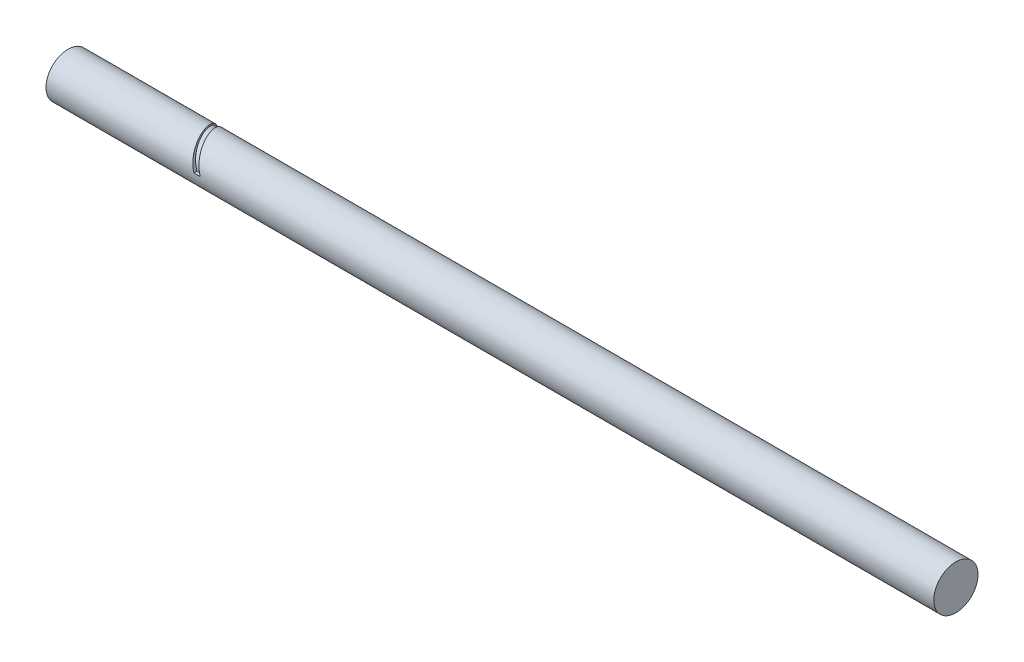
ISO-10303-21;
HEADER;
FILE_DESCRIPTION(('STEP AP214'),'2;1');
FILE_NAME('part.step','',(''),(''),'','','');
FILE_SCHEMA(('AUTOMOTIVE_DESIGN { 1 0 10303 214 1 1 1 1 }'));
ENDSEC;
DATA;
#1=APPLICATION_CONTEXT('core data for automotive mechanical design processes');
#2=APPLICATION_PROTOCOL_DEFINITION('international standard','automotive_design',2000,#1);
#3=PRODUCT_CONTEXT('',#1,'mechanical');
#4=PRODUCT('Part','Part','',(#3));
#5=PRODUCT_RELATED_PRODUCT_CATEGORY('part','',(#4));
#6=PRODUCT_DEFINITION_FORMATION('','',#4);
#7=PRODUCT_DEFINITION_CONTEXT('part definition',#1,'design');
#8=PRODUCT_DEFINITION('design','',#6,#7);
#9=PRODUCT_DEFINITION_SHAPE('','',#8);
#10=(LENGTH_UNIT() NAMED_UNIT(*) SI_UNIT(.MILLI.,.METRE.));
#11=(NAMED_UNIT(*) PLANE_ANGLE_UNIT() SI_UNIT($,.RADIAN.));
#12=(NAMED_UNIT(*) SI_UNIT($,.STERADIAN.) SOLID_ANGLE_UNIT());
#13=UNCERTAINTY_MEASURE_WITH_UNIT(LENGTH_MEASURE(1.E-05),#10,'distance_accuracy_value','');
#14=(GEOMETRIC_REPRESENTATION_CONTEXT(3) GLOBAL_UNCERTAINTY_ASSIGNED_CONTEXT((#13)) GLOBAL_UNIT_ASSIGNED_CONTEXT((#10,
#11,#12)) REPRESENTATION_CONTEXT('',''));
#15=CARTESIAN_POINT('',(0.,0.,0.));
#16=DIRECTION('',(0.,0.,1.));
#17=DIRECTION('',(1.,0.,0.));
#18=AXIS2_PLACEMENT_3D('',#15,#16,#17);
#19=CARTESIAN_POINT('',(3010.,0.,0.));
#20=DIRECTION('',(-1.,0.,0.));
#21=DIRECTION('',(0.,0.,1.));
#22=AXIS2_PLACEMENT_3D('',#19,#20,#21);
#23=CYLINDRICAL_SURFACE('',#22,87.375);
#24=DIRECTION('',(-1.,0.,0.));
#25=VECTOR('',#24,1.);
#26=CARTESIAN_POINT('',(3010.,0.,-87.375));
#27=LINE('',#26,#25);
#28=CARTESIAN_POINT('',(0.,0.,-87.375));
#29=VERTEX_POINT('',#28);
#30=CARTESIAN_POINT('',(20.,0.,-87.375));
#31=VERTEX_POINT('',#30);
#32=EDGE_CURVE('E253',#29,#31,#27,.F.);
#33=ORIENTED_EDGE('',*,*,#32,.T.);
#34=CARTESIAN_POINT('',(20.,0.,-87.375));
#35=CARTESIAN_POINT('',(20.4671642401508,1.50861786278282,-87.375036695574));
#36=CARTESIAN_POINT('',(20.9347925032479,3.01708702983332,-87.335929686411));
#37=CARTESIAN_POINT('',(21.8708867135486,6.02965014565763,-87.1797402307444));
#38=CARTESIAN_POINT('',(22.3393526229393,7.53374428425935,-87.0626612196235));
#39=CARTESIAN_POINT('',(23.2770656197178,10.5335897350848,-86.7508421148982));
#40=CARTESIAN_POINT('',(23.7463126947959,12.0293411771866,-86.5561032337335));
#41=CARTESIAN_POINT('',(24.6851978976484,15.0073260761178,-86.0897224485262));
#42=CARTESIAN_POINT('',(25.154835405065,16.4895694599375,-85.818142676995));
#43=CARTESIAN_POINT('',(26.0948836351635,19.4377960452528,-85.1987772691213));
#44=CARTESIAN_POINT('',(26.5652943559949,20.9037792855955,-84.8509918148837));
#45=CARTESIAN_POINT('',(27.5069142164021,23.8155736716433,-84.0801834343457));
#46=CARTESIAN_POINT('',(27.978123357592,25.2613847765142,-83.6571603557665));
#47=CARTESIAN_POINT('',(28.9214759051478,28.1293044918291,-82.7369404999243));
#48=CARTESIAN_POINT('',(29.3936195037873,29.5514074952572,-82.2397264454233));
#49=CARTESIAN_POINT('',(30.3387933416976,32.3677617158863,-81.1725710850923));
#50=CARTESIAN_POINT('',(30.8118235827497,33.7620128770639,-80.6026296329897));
#51=CARTESIAN_POINT('',(31.7587939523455,36.5189120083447,-79.3916018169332));
#52=CARTESIAN_POINT('',(32.2327340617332,37.8815606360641,-78.7505169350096));
#53=CARTESIAN_POINT('',(33.1815377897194,40.5719978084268,-77.3987759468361));
#54=CARTESIAN_POINT('',(33.6564015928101,41.8997784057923,-76.6881041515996));
#55=CARTESIAN_POINT('',(34.6069066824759,44.5166653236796,-75.1992249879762));
#56=CARTESIAN_POINT('',(35.0825479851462,45.8057708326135,-74.421016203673));
#57=CARTESIAN_POINT('',(36.0346330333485,48.3419797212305,-72.7991032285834));
#58=CARTESIAN_POINT('',(36.5110768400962,49.5890797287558,-71.9553937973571));
#59=CARTESIAN_POINT('',(37.3955936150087,51.8602956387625,-70.3317604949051));
#60=CARTESIAN_POINT('',(37.8035657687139,52.8905292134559,-69.560319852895));
#61=CARTESIAN_POINT('',(38.6201356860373,54.915868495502,-67.9727420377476));
#62=CARTESIAN_POINT('',(39.0287334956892,55.9109714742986,-67.1566014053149));
#63=CARTESIAN_POINT('',(39.8465460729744,57.8640217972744,-65.4813019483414));
#64=CARTESIAN_POINT('',(40.2557608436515,58.8219689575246,-64.6221429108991));
#65=CARTESIAN_POINT('',(41.0748675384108,60.6989385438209,-62.8624254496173));
#66=CARTESIAN_POINT('',(41.4847595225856,61.6179572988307,-61.9618631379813));
#67=CARTESIAN_POINT('',(42.3053169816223,63.4154433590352,-60.1209416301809));
#68=CARTESIAN_POINT('',(42.7159826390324,64.2938993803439,-59.180571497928));
#69=CARTESIAN_POINT('',(43.5379877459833,66.0084012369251,-57.2620021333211));
#70=CARTESIAN_POINT('',(43.9493272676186,66.8444421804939,-56.2837985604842));
#71=CARTESIAN_POINT('',(44.7725731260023,68.4723867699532,-54.2915979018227));
#72=CARTESIAN_POINT('',(45.1844794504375,69.2642913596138,-53.2776015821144));
#73=CARTESIAN_POINT('',(46.0088040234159,70.8023718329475,-51.2159023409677));
#74=CARTESIAN_POINT('',(46.4212222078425,71.5485529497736,-50.1682032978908));
#75=CARTESIAN_POINT('',(47.2475422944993,72.9954677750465,-48.0386629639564));
#76=CARTESIAN_POINT('',(47.6614454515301,73.6960960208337,-46.9567505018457));
#77=CARTESIAN_POINT('',(48.4897932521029,75.0486610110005,-44.7632568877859));
#78=CARTESIAN_POINT('',(48.9042378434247,75.7006021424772,-43.6516784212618));
#79=CARTESIAN_POINT('',(49.7337622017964,76.9546356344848,-41.4008987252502));
#80=CARTESIAN_POINT('',(50.1488420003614,77.5567254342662,-40.2616960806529));
#81=CARTESIAN_POINT('',(50.9796484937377,78.7098600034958,-37.9579739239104));
#82=CARTESIAN_POINT('',(51.3953751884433,79.2609047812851,-36.7934544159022));
#83=CARTESIAN_POINT('',(52.2273818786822,80.3108226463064,-34.4415531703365));
#84=CARTESIAN_POINT('',(52.6436617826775,80.8097034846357,-33.25417486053));
#85=CARTESIAN_POINT('',(53.4768508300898,81.7544918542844,-30.8585765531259));
#86=CARTESIAN_POINT('',(53.8937600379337,82.2003935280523,-29.6503542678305));
#87=CARTESIAN_POINT('',(54.7281540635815,83.0383130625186,-27.215561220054));
#88=CARTESIAN_POINT('',(55.145638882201,83.4303308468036,-25.9889904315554));
#89=CARTESIAN_POINT('',(55.9811375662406,84.1596980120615,-23.5200463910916));
#90=CARTESIAN_POINT('',(56.3991513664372,84.4970535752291,-22.2776749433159));
#91=CARTESIAN_POINT('',(57.2368133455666,85.1172881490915,-19.7763093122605));
#92=CARTESIAN_POINT('',(57.6564629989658,85.4000289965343,-18.5172813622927));
#93=CARTESIAN_POINT('',(58.4963523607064,85.9094542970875,-15.9881302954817));
#94=CARTESIAN_POINT('',(58.9165920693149,86.1361387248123,-14.7180071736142));
#95=CARTESIAN_POINT('',(59.7577162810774,86.5330298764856,-12.1691777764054));
#96=CARTESIAN_POINT('',(60.1786007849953,86.7032365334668,-10.8904714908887));
#97=CARTESIAN_POINT('',(61.0210094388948,86.9868662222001,-8.32698684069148));
#98=CARTESIAN_POINT('',(61.4425335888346,87.1002892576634,-7.04220847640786));
#99=CARTESIAN_POINT('',(62.2861497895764,87.2701540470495,-4.46913383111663));
#100=CARTESIAN_POINT('',(62.7082418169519,87.3265980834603,-3.18083769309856));
#101=CARTESIAN_POINT('',(63.5530362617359,87.3824299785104,-0.603077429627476));
#102=CARTESIAN_POINT('',(63.9757387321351,87.3818125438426,0.686386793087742));
#103=CARTESIAN_POINT('',(64.8216730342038,87.323536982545,3.2637204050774));
#104=CARTESIAN_POINT('',(65.2449048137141,87.2658840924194,4.55158992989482));
#105=CARTESIAN_POINT('',(66.0919848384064,87.093675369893,7.12344857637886));
#106=CARTESIAN_POINT('',(66.5158331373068,86.9791142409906,8.40743732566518));
#107=CARTESIAN_POINT('',(67.3651056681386,86.6930042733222,10.9718753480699));
#108=CARTESIAN_POINT('',(67.7905312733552,86.5213236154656,12.2523094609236));
#109=CARTESIAN_POINT('',(68.6419920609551,86.1214062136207,14.8041192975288));
#110=CARTESIAN_POINT('',(69.0680272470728,85.8931691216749,16.0754949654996));
#111=CARTESIAN_POINT('',(69.9207018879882,85.3806145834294,18.6066836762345));
#112=CARTESIAN_POINT('',(70.3473413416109,85.0962972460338,19.8664967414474));
#113=CARTESIAN_POINT('',(71.201244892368,84.4721685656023,22.3720863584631));
#114=CARTESIAN_POINT('',(71.6285089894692,84.1323572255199,23.6178629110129));
#115=CARTESIAN_POINT('',(72.4836780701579,83.3979001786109,26.0930549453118));
#116=CARTESIAN_POINT('',(72.9115831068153,83.0032496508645,27.3224689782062));
#117=CARTESIAN_POINT('',(73.7679777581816,82.1599376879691,29.7624156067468));
#118=CARTESIAN_POINT('',(74.1964673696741,81.7112765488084,30.9729483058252));
#119=CARTESIAN_POINT('',(75.0540561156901,80.7608231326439,33.3728310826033));
#120=CARTESIAN_POINT('',(75.4831552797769,80.2590281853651,34.5621800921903));
#121=CARTESIAN_POINT('',(76.3419104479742,79.2033849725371,36.91719658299));
#122=CARTESIAN_POINT('',(76.7715663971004,78.6495415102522,38.0828662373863));
#123=CARTESIAN_POINT('',(77.6326013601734,77.4893689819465,40.3913533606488));
#124=CARTESIAN_POINT('',(78.0639819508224,76.8829073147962,41.5341036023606));
#125=CARTESIAN_POINT('',(78.9273260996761,75.6200151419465,43.7912803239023));
#126=CARTESIAN_POINT('',(79.3592896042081,74.9635889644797,44.9057092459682));
#127=CARTESIAN_POINT('',(80.2238285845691,73.6020025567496,47.104222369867));
#128=CARTESIAN_POINT('',(80.656404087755,72.8968400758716,48.1883051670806));
#129=CARTESIAN_POINT('',(81.5221163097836,71.439217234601,50.3239532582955));
#130=CARTESIAN_POINT('',(81.9552530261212,70.6867570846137,51.3755186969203));
#131=CARTESIAN_POINT('',(82.8220057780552,69.1362054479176,53.4438576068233));
#132=CARTESIAN_POINT('',(83.2556216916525,68.3381237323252,54.4606384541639));
#133=CARTESIAN_POINT('',(84.1234491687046,66.6977842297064,56.457647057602));
#134=CARTESIAN_POINT('',(84.5576607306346,65.8555265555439,57.4378749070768));
#135=CARTESIAN_POINT('',(85.4267230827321,64.1284787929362,59.3599026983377));
#136=CARTESIAN_POINT('',(85.8615738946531,63.2436872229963,60.3017012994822));
#137=CARTESIAN_POINT('',(86.731881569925,61.4334501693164,62.1449152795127));
#138=CARTESIAN_POINT('',(87.1673383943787,60.5080071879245,63.0463331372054));
#139=CARTESIAN_POINT('',(88.1855609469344,58.3002097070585,65.1034178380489));
#140=CARTESIAN_POINT('',(88.7685932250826,57.0025356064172,66.2425816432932));
#141=CARTESIAN_POINT('',(89.9356645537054,54.3423148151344,68.4418153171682));
#142=CARTESIAN_POINT('',(90.5197036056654,52.9797680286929,69.5018850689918));
#143=CARTESIAN_POINT('',(91.6887714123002,50.194588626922,71.5392955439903));
#144=CARTESIAN_POINT('',(92.2738001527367,48.7719568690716,72.5166374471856));
#145=CARTESIAN_POINT('',(93.4451151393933,45.8710282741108,74.3856016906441));
#146=CARTESIAN_POINT('',(94.0314018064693,44.3927085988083,75.2771883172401));
#147=CARTESIAN_POINT('',(95.2050427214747,41.3861742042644,76.9711146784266));
#148=CARTESIAN_POINT('',(95.7923969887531,39.8579585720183,77.7734527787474));
#149=CARTESIAN_POINT('',(96.9682554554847,36.75693408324,79.2861560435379));
#150=CARTESIAN_POINT('',(97.5567597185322,35.1841226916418,79.9965159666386));
#151=CARTESIAN_POINT('',(98.6363021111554,32.2661016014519,81.211774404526));
#152=CARTESIAN_POINT('',(99.1271729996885,30.9268405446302,81.7311636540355));
#153=CARTESIAN_POINT('',(100.109711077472,28.2244474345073,82.7032841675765));
#154=CARTESIAN_POINT('',(100.60137833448,26.8613132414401,83.1560094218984));
#155=CARTESIAN_POINT('',(101.585460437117,24.1145392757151,83.993698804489));
#156=CARTESIAN_POINT('',(102.077875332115,22.7308980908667,84.3786582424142));
#157=CARTESIAN_POINT('',(103.063433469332,19.9464980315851,85.0798982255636));
#158=CARTESIAN_POINT('',(103.556576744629,18.5457383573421,85.3961755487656));
#159=CARTESIAN_POINT('',(104.544454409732,15.7280478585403,85.9597992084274));
#160=CARTESIAN_POINT('',(105.039190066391,14.3110925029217,86.2070206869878));
#161=CARTESIAN_POINT('',(106.029376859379,11.4669797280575,86.63120856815));
#162=CARTESIAN_POINT('',(106.52482798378,10.0398224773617,86.8081761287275));
#163=CARTESIAN_POINT('',(107.516465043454,7.17879944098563,87.0914545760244));
#164=CARTESIAN_POINT('',(108.012650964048,5.74493378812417,87.1977668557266));
#165=CARTESIAN_POINT('',(109.005764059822,2.87400175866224,87.3395542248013));
#166=CARTESIAN_POINT('',(109.502691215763,1.43693546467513,87.3750311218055));
#167=CARTESIAN_POINT('',(110.,0.,87.375));
#168=B_SPLINE_CURVE_WITH_KNOTS('',3,(#34,#35,#36,#37,#38,#39,#40,#41,#42,#43,#44,#45,#46,#47,
#48,#49,#50,#51,#52,#53,#54,#55,#56,#57,#58,#59,#60,#61,#62,#63,#64,#65,#66,#67,#68,#69,#70,#71,
#72,#73,#74,#75,#76,#77,#78,#79,#80,#81,#82,#83,#84,#85,#86,#87,#88,#89,#90,#91,#92,#93,#94,#95,
#96,#97,#98,#99,#100,#101,#102,#103,#104,#105,#106,#107,#108,#109,#110,#111,#112,#113,#114,#115,
#116,#117,#118,#119,#120,#121,#122,#123,#124,#125,#126,#127,#128,#129,#130,#131,#132,#133,#134,
#135,#136,#137,#138,#139,#140,#141,#142,#143,#144,#145,#146,#147,#148,#149,#150,#151,#152,#153,
#154,#155,#156,#157,#158,#159,#160,#161,#162,#163,#164,#165,#166,#167),.UNSPECIFIED.,.F.,.F.,(4,
2,2,2,2,2,2,2,2,2,2,2,2,2,2,2,2,2,2,2,2,2,2,2,2,2,2,2,2,2,2,2,2,2,2,2,2,2,2,2,2,2,2,2,2,2,2,2,2,
2,2,2,2,2,2,2,2,2,2,2,2,2,2,2,2,2,4),(0.,4.7373916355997,9.47457455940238,14.2116835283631,
18.9449730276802,23.6782512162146,28.4115389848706,33.1459307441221,37.8803320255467,
42.6146347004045,47.3500072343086,52.0854790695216,56.8213301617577,60.8706623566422,
64.9203083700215,68.969974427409,73.0200215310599,77.0711885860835,81.1228218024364,
85.1743683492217,89.2254503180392,93.2855997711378,97.3453829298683,101.405374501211,
105.465365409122,109.524752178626,113.58458735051,117.644428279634,121.703809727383,
125.773329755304,129.842851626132,133.912378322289,137.981904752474,142.051268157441,
146.121009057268,150.19037634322,154.260122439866,158.339326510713,162.418555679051,
166.497776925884,170.576997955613,174.656577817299,178.736135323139,182.815897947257,
186.89528444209,190.985267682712,195.074897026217,199.164715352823,203.254515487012,
207.343442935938,211.432359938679,215.521419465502,219.61022763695,225.074783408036,
230.53934724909,236.003833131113,241.470584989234,246.937436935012,252.404600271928,
256.95702424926,261.509858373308,266.063007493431,270.61637016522,275.1779131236,
279.739380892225,284.300758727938,288.862020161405),.UNSPECIFIED.);
#169=CARTESIAN_POINT('',(110.,0.,87.375));
#170=VERTEX_POINT('',#169);
#171=EDGE_CURVE('E13',#31,#170,#168,.T.);
#172=ORIENTED_EDGE('',*,*,#171,.T.);
#173=DIRECTION('',(-1.,0.,0.));
#174=VECTOR('',#173,1.);
#175=CARTESIAN_POINT('',(3010.,0.,87.375));
#176=LINE('',#175,#174);
#177=CARTESIAN_POINT('',(84.9999999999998,0.,87.375));
#178=VERTEX_POINT('',#177);
#179=EDGE_CURVE('E83',#178,#170,#176,.F.);
#180=ORIENTED_EDGE('',*,*,#179,.F.);
#181=CARTESIAN_POINT('',(84.9999999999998,0.,87.375));
#182=CARTESIAN_POINT('',(84.5366335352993,1.50976577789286,87.3750259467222));
#183=CARTESIAN_POINT('',(84.0714954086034,3.01898793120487,87.335870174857));
#184=CARTESIAN_POINT('',(83.1388207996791,6.03260120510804,87.1795481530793));
#185=CARTESIAN_POINT('',(82.6712843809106,7.53699245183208,87.06238395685));
#186=CARTESIAN_POINT('',(81.7349368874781,10.5372696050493,86.7503990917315));
#187=CARTESIAN_POINT('',(81.2661258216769,12.0331555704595,86.5555789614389));
#188=CARTESIAN_POINT('',(80.3285997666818,15.0117218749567,86.0889607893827));
#189=CARTESIAN_POINT('',(79.8598849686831,16.494411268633,85.8172205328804));
#190=CARTESIAN_POINT('',(79.1574656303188,18.7064613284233,85.3523687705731));
#191=CARTESIAN_POINT('',(78.9234264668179,19.4418395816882,85.1878711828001));
#192=CARTESIAN_POINT('',(78.4556827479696,20.9082126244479,84.8398788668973));
#193=CARTESIAN_POINT('',(78.2219781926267,21.6392074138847,84.6563841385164));
#194=CARTESIAN_POINT('',(77.7550288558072,23.0963418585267,84.2705028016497));
#195=CARTESIAN_POINT('',(77.5217840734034,23.8224815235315,84.0681162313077));
#196=CARTESIAN_POINT('',(77.0559623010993,25.2694532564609,83.6445679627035));
#197=CARTESIAN_POINT('',(76.8233853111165,25.9902853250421,83.4234062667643));
#198=CARTESIAN_POINT('',(76.1262159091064,28.1444399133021,82.7318289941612));
#199=CARTESIAN_POINT('',(75.6622754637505,29.569138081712,82.2333960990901));
#200=CARTESIAN_POINT('',(74.9655287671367,31.6849356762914,81.4311050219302));
#201=CARTESIAN_POINT('',(74.7331313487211,32.3866871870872,81.154555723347));
#202=CARTESIAN_POINT('',(74.2676326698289,33.7826194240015,80.583458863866));
#203=CARTESIAN_POINT('',(74.0345314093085,34.4768001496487,80.2889113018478));
#204=CARTESIAN_POINT('',(73.5677391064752,35.8571264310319,79.682027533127));
#205=CARTESIAN_POINT('',(73.3340480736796,36.5432721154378,79.3696916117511));
#206=CARTESIAN_POINT('',(72.8662687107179,37.9071187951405,78.7274361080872));
#207=CARTESIAN_POINT('',(72.6321803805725,38.5848197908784,78.3975165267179));
#208=CARTESIAN_POINT('',(71.9294494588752,40.6049640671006,77.3815207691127));
#209=CARTESIAN_POINT('',(71.4603988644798,41.934277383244,76.6692828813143));
#210=CARTESIAN_POINT('',(70.7571406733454,43.899172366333,75.5501274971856));
#211=CARTESIAN_POINT('',(70.5227625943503,44.5493230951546,75.1685890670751));
#212=CARTESIAN_POINT('',(70.0542433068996,45.8396176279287,74.3887641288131));
#213=CARTESIAN_POINT('',(69.8201020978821,46.479761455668,73.9904776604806));
#214=CARTESIAN_POINT('',(69.3522311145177,47.7496763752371,73.1773705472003));
#215=CARTESIAN_POINT('',(69.1185013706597,48.3794467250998,72.7625487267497));
#216=CARTESIAN_POINT('',(68.6515708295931,49.6281764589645,71.9166422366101));
#217=CARTESIAN_POINT('',(68.4183700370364,50.2471357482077,71.4855574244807));
#218=CARTESIAN_POINT('',(67.9205542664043,51.5573882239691,70.5475794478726));
#219=CARTESIAN_POINT('',(67.6559905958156,52.247039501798,70.0383631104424));
#220=CARTESIAN_POINT('',(67.1271141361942,53.6111233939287,68.9998037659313));
#221=CARTESIAN_POINT('',(66.8628013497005,54.2855558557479,68.4704605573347));
#222=CARTESIAN_POINT('',(66.3341872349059,55.6186192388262,67.3920979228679));
#223=CARTESIAN_POINT('',(66.0698859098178,56.2772487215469,66.8430767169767));
#224=CARTESIAN_POINT('',(65.5411034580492,57.5780194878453,65.7259256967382));
#225=CARTESIAN_POINT('',(65.2766223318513,58.2201608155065,65.1577959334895));
#226=CARTESIAN_POINT('',(64.7472708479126,59.4873777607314,64.0029483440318));
#227=CARTESIAN_POINT('',(64.4824004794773,60.1124528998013,63.4162299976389));
#228=CARTESIAN_POINT('',(63.9520277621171,61.3449285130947,62.224794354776));
#229=CARTESIAN_POINT('',(63.6865254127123,61.9523289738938,61.620077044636));
#230=CARTESIAN_POINT('',(63.1547728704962,63.1491723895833,60.3929421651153));
#231=CARTESIAN_POINT('',(62.8885224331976,63.7386084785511,59.7705179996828));
#232=CARTESIAN_POINT('',(62.3556875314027,64.8988187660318,58.5087059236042));
#233=CARTESIAN_POINT('',(62.0891030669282,65.4695929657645,57.8693180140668));
#234=CARTESIAN_POINT('',(61.2891746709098,67.153287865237,55.9264083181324));
#235=CARTESIAN_POINT('',(60.7555944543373,68.2377187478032,54.5979991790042));
#236=CARTESIAN_POINT('',(59.9564443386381,69.8043661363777,52.5592630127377));
#237=CARTESIAN_POINT('',(59.6902529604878,70.3166027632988,51.8719667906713));
#238=CARTESIAN_POINT('',(59.1584549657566,71.3207585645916,50.482419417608));
#239=CARTESIAN_POINT('',(58.89284834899,71.8126777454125,49.7801682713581));
#240=CARTESIAN_POINT('',(58.3625352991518,72.7758239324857,48.3611975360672));
#241=CARTESIAN_POINT('',(58.0978289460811,73.2470491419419,47.6444766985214));
#242=CARTESIAN_POINT('',(57.5689921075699,74.1682821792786,46.1973188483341));
#243=CARTESIAN_POINT('',(57.3048616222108,74.6182900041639,45.4668818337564));
#244=CARTESIAN_POINT('',(56.7766135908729,75.4966078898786,43.9930529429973));
#245=CARTESIAN_POINT('',(56.512496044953,75.9249178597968,43.2496610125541));
#246=CARTESIAN_POINT('',(56.1159692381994,76.5507613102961,42.1254737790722));
#247=CARTESIAN_POINT('',(55.9837335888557,76.7566079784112,41.7492234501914));
#248=CARTESIAN_POINT('',(55.7190728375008,77.1627121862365,40.993784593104));
#249=CARTESIAN_POINT('',(55.5866477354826,77.3629697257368,40.6145960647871));
#250=CARTESIAN_POINT('',(55.1891090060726,77.9552974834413,39.4727449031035));
#251=CARTESIAN_POINT('',(54.9237257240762,78.3389326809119,38.7057790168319));
#252=CARTESIAN_POINT('',(54.3924384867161,79.083388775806,37.1610464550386));
#253=CARTESIAN_POINT('',(54.1265345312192,79.4442096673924,36.3832797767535));
#254=CARTESIAN_POINT('',(53.5943963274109,80.1427232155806,34.8176566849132));
#255=CARTESIAN_POINT('',(53.328162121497,80.480418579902,34.0298014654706));
#256=CARTESIAN_POINT('',(52.7954954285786,81.13245980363,32.4445547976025));
#257=CARTESIAN_POINT('',(52.5290629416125,81.4468056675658,31.6471633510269));
#258=CARTESIAN_POINT('',(51.9961560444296,82.0518994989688,30.0434834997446));
#259=CARTESIAN_POINT('',(51.7296816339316,82.3426473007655,29.2371950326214));
#260=CARTESIAN_POINT('',(51.1968503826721,82.9003066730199,27.6163770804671));
#261=CARTESIAN_POINT('',(50.9304935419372,83.1672182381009,26.8018475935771));
#262=CARTESIAN_POINT('',(50.3980592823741,83.6769818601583,25.1652130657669));
#263=CARTESIAN_POINT('',(50.1319818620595,83.9198340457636,24.3431080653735));
#264=CARTESIAN_POINT('',(49.6002617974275,84.381278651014,22.6919635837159));
#265=CARTESIAN_POINT('',(49.3346191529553,84.5998710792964,21.8629241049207));
#266=CARTESIAN_POINT('',(48.9366063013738,84.9094234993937,20.6146609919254));
#267=CARTESIAN_POINT('',(48.8040031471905,85.0095566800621,20.1977659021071));
#268=CARTESIAN_POINT('',(48.5389687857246,85.2036875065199,19.3624919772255));
#269=CARTESIAN_POINT('',(48.4065375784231,85.2976851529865,18.9441131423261));
#270=CARTESIAN_POINT('',(48.1418714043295,85.4795229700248,18.1059568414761));
#271=CARTESIAN_POINT('',(48.0096364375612,85.5673631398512,17.6861793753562));
#272=CARTESIAN_POINT('',(47.811445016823,85.694488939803,17.0555320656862));
#273=CARTESIAN_POINT('',(47.745407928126,85.7360918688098,16.8451523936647));
#274=CARTESIAN_POINT('',(47.6132868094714,85.8177451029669,16.4241054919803));
#275=CARTESIAN_POINT('',(47.5472027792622,85.8577953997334,16.213438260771));
#276=CARTESIAN_POINT('',(47.3489090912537,85.975614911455,15.5810199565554));
#277=CARTESIAN_POINT('',(47.2166557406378,86.0510540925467,15.1588456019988));
#278=CARTESIAN_POINT('',(46.9520338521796,86.1957028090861,14.3134674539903));
#279=CARTESIAN_POINT('',(46.8196653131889,86.2649122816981,13.8902636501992));
#280=CARTESIAN_POINT('',(46.4224110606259,86.463175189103,12.6192462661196));
#281=CARTESIAN_POINT('',(46.1573688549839,86.5828677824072,11.7700016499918));
#282=CARTESIAN_POINT('',(45.6269676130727,86.7971888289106,10.0684614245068));
#283=CARTESIAN_POINT('',(45.3616085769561,86.8918172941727,9.21616581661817));
#284=CARTESIAN_POINT('',(44.8306597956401,87.0559414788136,7.50925548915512));
#285=CARTESIAN_POINT('',(44.5650700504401,87.125437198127,6.65464076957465));
#286=CARTESIAN_POINT('',(43.7680529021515,87.29613548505,4.08834034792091));
#287=CARTESIAN_POINT('',(43.2363369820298,87.3595655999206,2.37406798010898));
#288=CARTESIAN_POINT('',(42.1728731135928,87.3854567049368,-1.05509880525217));
#289=CARTESIAN_POINT('',(41.641125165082,87.3479169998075,-2.76999322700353));
#290=CARTESIAN_POINT('',(40.5780863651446,87.1719779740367,-6.19486919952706));
#291=CARTESIAN_POINT('',(40.0467955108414,87.0335792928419,-7.90485078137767));
#292=CARTESIAN_POINT('',(39.2507488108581,86.7506970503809,-10.4614851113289));
#293=CARTESIAN_POINT('',(38.9855449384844,86.6438538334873,-11.312317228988));
#294=CARTESIAN_POINT('',(38.5880011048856,86.4648295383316,-12.5860110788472));
#295=CARTESIAN_POINT('',(38.4555287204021,86.4020274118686,-13.0101545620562));
#296=CARTESIAN_POINT('',(38.1906798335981,86.2701807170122,-13.8575033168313));
#297=CARTESIAN_POINT('',(38.0583033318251,86.2011361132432,-14.2807085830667));
#298=CARTESIAN_POINT('',(37.7936612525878,86.0568176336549,-15.1260911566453));
#299=CARTESIAN_POINT('',(37.661395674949,85.9815437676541,-15.5482684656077));
#300=CARTESIAN_POINT('',(37.4630793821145,85.8639730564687,-16.1806901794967));
#301=CARTESIAN_POINT('',(37.3969874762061,85.8240060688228,-16.3913571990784));
#302=CARTESIAN_POINT('',(37.2648501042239,85.7425193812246,-16.8124053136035));
#303=CARTESIAN_POINT('',(37.1988046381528,85.7009996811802,-17.0227864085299));
#304=CARTESIAN_POINT('',(37.0005934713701,85.5741235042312,-17.6534397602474));
#305=CARTESIAN_POINT('',(36.8683522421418,85.4864494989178,-18.0732245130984));
#306=CARTESIAN_POINT('',(36.6036731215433,85.3049445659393,-18.9113967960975));
#307=CARTESIAN_POINT('',(36.4712352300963,85.2111136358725,-19.3297843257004));
#308=CARTESIAN_POINT('',(36.2061903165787,85.0173149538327,-20.1650836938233));
#309=CARTESIAN_POINT('',(36.0735832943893,84.917347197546,-20.5819955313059));
#310=CARTESIAN_POINT('',(35.8082222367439,84.7112985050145,-21.4142549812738));
#311=CARTESIAN_POINT('',(35.675468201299,84.6052175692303,-21.829602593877));
#312=CARTESIAN_POINT('',(35.2770176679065,84.277838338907,-23.0731770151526));
#313=CARTESIAN_POINT('',(35.0111262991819,84.0473989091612,-23.8989557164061));
#314=CARTESIAN_POINT('',(34.4790064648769,83.5623533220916,-25.5432677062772));
#315=CARTESIAN_POINT('',(34.2127779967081,83.3077469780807,-26.3618009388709));
#316=CARTESIAN_POINT('',(33.680139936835,82.7745777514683,-27.9909718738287));
#317=CARTESIAN_POINT('',(33.4137303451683,82.4960148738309,-28.8016095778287));
#318=CARTESIAN_POINT('',(32.8808845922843,81.9151602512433,-30.4143341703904));
#319=CARTESIAN_POINT('',(32.614448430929,81.6128683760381,-31.2164210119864));
#320=CARTESIAN_POINT('',(32.0817024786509,80.9848005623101,-32.8113897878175));
#321=CARTESIAN_POINT('',(31.8153926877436,80.6590246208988,-33.6042717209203));
#322=CARTESIAN_POINT('',(31.2830531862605,79.9842504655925,-35.1801790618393));
#323=CARTESIAN_POINT('',(31.0170234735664,79.6352524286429,-35.9632045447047));
#324=CARTESIAN_POINT('',(30.485391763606,78.9143064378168,-37.5187652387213));
#325=CARTESIAN_POINT('',(30.2197897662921,78.542358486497,-38.2913004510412));
#326=CARTESIAN_POINT('',(29.6891291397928,77.7757347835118,-39.825382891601));
#327=CARTESIAN_POINT('',(29.4240706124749,77.381055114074,-40.5869281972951));
#328=CARTESIAN_POINT('',(28.8946738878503,76.5693332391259,-42.0982604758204));
#329=CARTESIAN_POINT('',(28.6303356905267,76.1522910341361,-42.8480474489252));
#330=CARTESIAN_POINT('',(28.1018585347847,75.2962719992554,-44.3350659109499));
#331=CARTESIAN_POINT('',(27.8377195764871,74.8572951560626,-45.0722973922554));
#332=CARTESIAN_POINT('',(27.3091789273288,73.9578614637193,-46.5334429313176));
#333=CARTESIAN_POINT('',(27.0447772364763,73.497404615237,-47.2573569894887));
#334=CARTESIAN_POINT('',(26.5151608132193,72.555513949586,-48.6911056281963));
#335=CARTESIAN_POINT('',(26.2499460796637,72.0740801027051,-49.4009401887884));
#336=CARTESIAN_POINT('',(25.7187912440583,71.0906574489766,-50.8059479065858));
#337=CARTESIAN_POINT('',(25.452851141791,70.5886686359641,-51.5011210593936));
#338=CARTESIAN_POINT('',(24.9205532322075,69.5645889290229,-52.8762083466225));
#339=CARTESIAN_POINT('',(24.6541954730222,69.0425002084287,-53.5561241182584));
#340=CARTESIAN_POINT('',(24.121253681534,67.9785876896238,-54.9002448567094));
#341=CARTESIAN_POINT('',(23.85466964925,67.4367638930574,-55.5644498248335));
#342=CARTESIAN_POINT('',(23.3215027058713,66.3338043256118,-56.8766350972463));
#343=CARTESIAN_POINT('',(23.0549197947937,65.772668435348,-57.5246153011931));
#344=CARTESIAN_POINT('',(22.5219779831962,64.6315263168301,-58.8038356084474));
#345=CARTESIAN_POINT('',(22.2556190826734,64.0515200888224,-59.4350757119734));
#346=CARTESIAN_POINT('',(21.7233555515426,62.8730905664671,-60.6803092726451));
#347=CARTESIAN_POINT('',(21.4574509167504,62.2746674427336,-61.2943028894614));
#348=CARTESIAN_POINT('',(20.9263013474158,61.0598613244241,-62.5045521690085));
#349=CARTESIAN_POINT('',(20.6610564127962,60.4434783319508,-63.1008078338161));
#350=CARTESIAN_POINT('',(20.1310923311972,59.1935152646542,-64.2748266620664));
#351=CARTESIAN_POINT('',(19.8663730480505,58.5599405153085,-64.85259543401));
#352=CARTESIAN_POINT('',(19.3371829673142,57.2760006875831,-65.9892832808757));
#353=CARTESIAN_POINT('',(19.0727121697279,56.6256356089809,-66.5482023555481));
#354=CARTESIAN_POINT('',(18.5438210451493,55.3087212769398,-67.6466643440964));
#355=CARTESIAN_POINT('',(18.2794007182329,54.6421719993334,-68.1862072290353));
#356=CARTESIAN_POINT('',(17.7504145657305,53.293516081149,-69.2454111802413));
#357=CARTESIAN_POINT('',(17.4858487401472,52.6114094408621,-69.7650722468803));
#358=CARTESIAN_POINT('',(16.9563874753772,51.2322699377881,-70.7840392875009));
#359=CARTESIAN_POINT('',(16.691492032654,50.5352369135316,-71.2833450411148));
#360=CARTESIAN_POINT('',(16.1611550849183,49.1269212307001,-72.2611314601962));
#361=CARTESIAN_POINT('',(15.8957135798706,48.4156385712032,-72.7396121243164));
#362=CARTESIAN_POINT('',(15.3641179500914,46.9790659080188,-73.675594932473));
#363=CARTESIAN_POINT('',(15.0979635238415,46.2537687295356,-74.1330859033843));
#364=CARTESIAN_POINT('',(14.5653647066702,44.7901368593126,-75.0264587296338));
#365=CARTESIAN_POINT('',(14.2989203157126,44.0518021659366,-75.4623405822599));
#366=CARTESIAN_POINT('',(13.4994337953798,41.8180421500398,-76.737088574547));
#367=CARTESIAN_POINT('',(12.9661840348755,40.3037142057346,-77.5431527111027));
#368=CARTESIAN_POINT('',(12.1674017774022,37.9986730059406,-78.684350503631));
#369=CARTESIAN_POINT('',(11.9013162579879,37.2247140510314,-79.0534419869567));
#370=CARTESIAN_POINT('',(11.3696451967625,35.666089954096,-79.7687642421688));
#371=CARTESIAN_POINT('',(11.1040596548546,34.8814248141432,-80.1149950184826));
#372=CARTESIAN_POINT('',(10.5734674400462,33.3014034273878,-80.784552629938));
#373=CARTESIAN_POINT('',(10.3084613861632,32.5060392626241,-81.1078612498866));
#374=CARTESIAN_POINT('',(9.77892759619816,30.9059861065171,-81.7309472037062));
#375=CARTESIAN_POINT('',(9.51439986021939,30.1012971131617,-82.0307245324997));
#376=CARTESIAN_POINT('',(8.98532651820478,28.4833980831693,-82.6064401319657));
#377=CARTESIAN_POINT('',(8.72078091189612,27.6701876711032,-82.8823773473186));
#378=CARTESIAN_POINT('',(8.19120015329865,26.0361331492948,-83.4101167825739));
#379=CARTESIAN_POINT('',(7.92616500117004,25.2152890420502,-83.6619190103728));
#380=CARTESIAN_POINT('',(7.39536198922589,23.5665961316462,-84.1412102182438));
#381=CARTESIAN_POINT('',(7.12959401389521,22.7387461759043,-84.3686951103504));
#382=CARTESIAN_POINT('',(6.59762310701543,21.0768619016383,-84.7991357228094));
#383=CARTESIAN_POINT('',(6.33142017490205,20.2428275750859,-85.0020914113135));
#384=CARTESIAN_POINT('',(5.53346577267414,17.7358605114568,-85.5731455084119));
#385=CARTESIAN_POINT('',(5.00123186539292,16.0545314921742,-85.9044573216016));
#386=CARTESIAN_POINT('',(3.93698080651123,12.6757216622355,-86.4676258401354));
#387=CARTESIAN_POINT('',(3.40496363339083,10.9782436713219,-86.6994995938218));
#388=CARTESIAN_POINT('',(2.34242250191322,7.57316159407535,-87.0630046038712));
#389=CARTESIAN_POINT('',(1.81189778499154,5.86556500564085,-87.1947025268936));
#390=CARTESIAN_POINT('',(1.1754465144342,3.80938511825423,-87.2926078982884));
#391=CARTESIAN_POINT('',(1.06834972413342,3.46312716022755,-87.3070301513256));
#392=CARTESIAN_POINT('',(0.854266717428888,2.77046699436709,-87.3317536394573));
#393=CARTESIAN_POINT('',(0.747280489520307,2.4240648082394,-87.3420553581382));
#394=CARTESIAN_POINT('',(0.533516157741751,1.73145147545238,-87.3585290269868));
#395=CARTESIAN_POINT('',(0.426737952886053,1.38524044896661,-87.3647047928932));
#396=CARTESIAN_POINT('',(0.213285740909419,0.692692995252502,-87.3729405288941));
#397=CARTESIAN_POINT('',(0.106611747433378,0.346356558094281,-87.3750000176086));
#398=CARTESIAN_POINT('',(0.,0.,-87.375));
#399=B_SPLINE_CURVE_WITH_KNOTS('',3,(#181,#182,#183,#184,#185,#186,#187,#188,#189,#190,#191,
#192,#193,#194,#195,#196,#197,#198,#199,#200,#201,#202,#203,#204,#205,#206,#207,#208,#209,#210,
#211,#212,#213,#214,#215,#216,#217,#218,#219,#220,#221,#222,#223,#224,#225,#226,#227,#228,#229,
#230,#231,#232,#233,#234,#235,#236,#237,#238,#239,#240,#241,#242,#243,#244,#245,#246,#247,#248,
#249,#250,#251,#252,#253,#254,#255,#256,#257,#258,#259,#260,#261,#262,#263,#264,#265,#266,#267,
#268,#269,#270,#271,#272,#273,#274,#275,#276,#277,#278,#279,#280,#281,#282,#283,#284,#285,#286,
#287,#288,#289,#290,#291,#292,#293,#294,#295,#296,#297,#298,#299,#300,#301,#302,#303,#304,#305,
#306,#307,#308,#309,#310,#311,#312,#313,#314,#315,#316,#317,#318,#319,#320,#321,#322,#323,#324,
#325,#326,#327,#328,#329,#330,#331,#332,#333,#334,#335,#336,#337,#338,#339,#340,#341,#342,#343,
#344,#345,#346,#347,#348,#349,#350,#351,#352,#353,#354,#355,#356,#357,#358,#359,#360,#361,#362,
#363,#364,#365,#366,#367,#368,#369,#370,#371,#372,#373,#374,#375,#376,#377,#378,#379,#380,#381,
#382,#383,#384,#385,#386,#387,#388,#389,#390,#391,#392,#393,#394,#395,#396,#397,#398),
.UNSPECIFIED.,.F.,.F.,(4,2,2,2,2,2,2,2,2,2,2,2,2,2,2,2,2,2,2,2,2,2,2,2,2,2,2,2,2,2,2,2,2,2,2,2,
2,2,2,2,2,2,2,2,2,2,2,2,2,2,2,2,2,2,2,2,2,2,2,2,2,2,2,2,2,2,2,2,2,2,2,2,2,2,2,2,2,2,2,2,2,2,2,2,
2,2,2,2,2,2,2,2,2,2,2,2,2,2,2,2,2,2,2,2,2,2,2,2,4),(0.,4.73733621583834,9.47454771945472,
14.2117263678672,18.9453556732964,21.3123363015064,23.6793169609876,26.046292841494,
28.4132684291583,33.1481370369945,35.5157580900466,37.8833792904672,40.2509625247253,
42.6185456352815,47.3542987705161,49.7224105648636,52.0905167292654,54.4587915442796,
56.8270871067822,59.5182350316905,62.2094099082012,64.9008288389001,67.5922405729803,
70.2837276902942,72.9752168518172,75.6677221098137,78.3602271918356,83.7446178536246,
86.4370438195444,89.1294689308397,91.8221273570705,94.5147861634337,97.2074562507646,
98.5538244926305,99.9001927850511,102.592865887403,105.285539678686,107.977897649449,
110.670255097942,113.362631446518,116.055008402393,118.747370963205,121.439732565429,
122.786063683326,124.132394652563,125.478725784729,126.151893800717,126.825065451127,
128.171387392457,129.517722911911,132.210313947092,134.902903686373,137.595493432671,
142.980260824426,148.365065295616,153.749835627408,156.442286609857,157.788541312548,
159.134803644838,160.481063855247,161.154197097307,161.827330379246,163.1735891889,
164.519848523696,165.866108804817,167.212368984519,169.904823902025,172.597299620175,
175.289774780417,177.982264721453,180.67475499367,183.367224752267,186.059694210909,
188.752629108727,191.44556394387,194.138500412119,196.83143679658,199.524376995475,
202.21731800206,204.909968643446,207.60261906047,210.29528612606,212.987953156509,
215.68059524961,218.37323702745,221.065054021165,223.756871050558,226.44869209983,
229.140513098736,231.832363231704,234.52421353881,237.217480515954,239.910747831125,
245.296733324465,247.989864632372,250.682995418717,253.3782428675,256.073490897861,
258.768858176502,261.464224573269,264.160043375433,266.855865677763,272.235976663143,
277.615164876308,282.990770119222,284.078950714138,285.167003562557,286.254048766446,
287.341221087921),.UNSPECIFIED.);
#400=EDGE_CURVE('E123',#178,#29,#399,.T.);
#401=ORIENTED_EDGE('',*,*,#400,.T.);
#402=EDGE_LOOP('',(#33,#172,#180,#401));
#403=FACE_BOUND('',#402,.T.);
#404=CARTESIAN_POINT('',(3010.,0.,0.));
#405=DIRECTION('',(1.,0.,0.));
#406=DIRECTION('',(0.,0.,-1.));
#407=AXIS2_PLACEMENT_3D('',#404,#405,#406);
#408=CIRCLE('',#407,87.375);
#409=CARTESIAN_POINT('',(3010.,0.,-87.375));
#410=VERTEX_POINT('',#409);
#411=EDGE_CURVE('E263',#410,#410,#408,.T.);
#412=ORIENTED_EDGE('',*,*,#411,.F.);
#413=EDGE_LOOP('',(#412));
#414=FACE_BOUND('',#413,.T.);
#415=CARTESIAN_POINT('',(-500.,0.,0.));
#416=DIRECTION('',(1.,0.,0.));
#417=DIRECTION('',(0.,0.,-1.));
#418=AXIS2_PLACEMENT_3D('',#415,#416,#417);
#419=CIRCLE('',#418,87.375);
#420=CARTESIAN_POINT('',(-500.,0.,-87.375));
#421=VERTEX_POINT('',#420);
#422=EDGE_CURVE('E211',#421,#421,#419,.T.);
#423=ORIENTED_EDGE('',*,*,#422,.T.);
#424=EDGE_LOOP('',(#423));
#425=FACE_BOUND('',#424,.T.);
#426=ADVANCED_FACE('F73',(#403,#414,#425),#23,.T.);
#427=CARTESIAN_POINT('',(3010.,0.,0.));
#428=DIRECTION('',(1.,0.,0.));
#429=DIRECTION('',(0.,0.,-1.));
#430=AXIS2_PLACEMENT_3D('',#427,#428,#429);
#431=PLANE('',#430);
#432=ORIENTED_EDGE('',*,*,#411,.T.);
#433=EDGE_LOOP('',(#432));
#434=FACE_BOUND('',#433,.T.);
#435=ADVANCED_FACE('F272',(#434),#431,.T.);
#436=CARTESIAN_POINT('',(-500.,0.,0.));
#437=DIRECTION('',(1.,0.,0.));
#438=DIRECTION('',(0.,0.,-1.));
#439=AXIS2_PLACEMENT_3D('',#436,#437,#438);
#440=PLANE('',#439);
#441=ORIENTED_EDGE('',*,*,#422,.F.);
#442=EDGE_LOOP('',(#441));
#443=FACE_BOUND('',#442,.T.);
#444=ADVANCED_FACE('F223',(#443),#440,.F.);
#445=CARTESIAN_POINT('',(110.,0.,75.));
#446=DIRECTION('',(0.,1.,0.));
#447=DIRECTION('',(0.,0.,1.));
#448=AXIS2_PLACEMENT_3D('',#445,#446,#447);
#449=PLANE('',#448);
#450=ORIENTED_EDGE('',*,*,#179,.T.);
#451=DIRECTION('',(0.,0.,-1.));
#452=VECTOR('',#451,1.);
#453=CARTESIAN_POINT('',(110.,0.,89.));
#454=LINE('',#453,#452);
#455=CARTESIAN_POINT('',(110.,0.,75.));
#456=VERTEX_POINT('',#455);
#457=EDGE_CURVE('E132',#170,#456,#454,.T.);
#458=ORIENTED_EDGE('',*,*,#457,.T.);
#459=DIRECTION('',(-1.,0.,0.));
#460=VECTOR('',#459,1.);
#461=CARTESIAN_POINT('',(110.,0.,75.));
#462=LINE('',#461,#460);
#463=CARTESIAN_POINT('',(85.,0.,75.));
#464=VERTEX_POINT('',#463);
#465=EDGE_CURVE('E125',#456,#464,#462,.T.);
#466=ORIENTED_EDGE('',*,*,#465,.T.);
#467=DIRECTION('',(0.,0.,1.));
#468=VECTOR('',#467,1.);
#469=CARTESIAN_POINT('',(84.9999999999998,0.,89.));
#470=LINE('',#469,#468);
#471=EDGE_CURVE('E115',#464,#178,#470,.T.);
#472=ORIENTED_EDGE('',*,*,#471,.T.);
#473=EDGE_LOOP('',(#450,#458,#466,#472));
#474=FACE_BOUND('',#473,.T.);
#475=ADVANCED_FACE('F131',(#474),#449,.T.);
#476=CARTESIAN_POINT('',(20.,0.,-85.));
#477=DIRECTION('',(0.,-1.,0.));
#478=DIRECTION('',(0.,0.,-1.));
#479=AXIS2_PLACEMENT_3D('',#476,#477,#478);
#480=PLANE('',#479);
#481=DIRECTION('',(0.,0.,1.));
#482=VECTOR('',#481,1.);
#483=CARTESIAN_POINT('',(0.,0.,-89.));
#484=LINE('',#483,#482);
#485=CARTESIAN_POINT('',(0.,0.,-85.));
#486=VERTEX_POINT('',#485);
#487=EDGE_CURVE('E91',#29,#486,#484,.T.);
#488=ORIENTED_EDGE('',*,*,#487,.T.);
#489=DIRECTION('',(1.,0.,0.));
#490=VECTOR('',#489,1.);
#491=CARTESIAN_POINT('',(20.,0.,-85.));
#492=LINE('',#491,#490);
#493=CARTESIAN_POINT('',(20.,0.,-85.));
#494=VERTEX_POINT('',#493);
#495=EDGE_CURVE('E142',#486,#494,#492,.T.);
#496=ORIENTED_EDGE('',*,*,#495,.T.);
#497=DIRECTION('',(0.,0.,-1.));
#498=VECTOR('',#497,1.);
#499=CARTESIAN_POINT('',(20.,0.,-89.));
#500=LINE('',#499,#498);
#501=EDGE_CURVE('E77',#494,#31,#500,.T.);
#502=ORIENTED_EDGE('',*,*,#501,.T.);
#503=ORIENTED_EDGE('',*,*,#32,.F.);
#504=EDGE_LOOP('',(#488,#496,#502,#503));
#505=FACE_BOUND('',#504,.T.);
#506=ADVANCED_FACE('F178',(#505),#480,.F.);
#507=CARTESIAN_POINT('',(20.,0.,-85.));
#508=CARTESIAN_POINT('',(22.8139320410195,8.8402282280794,-84.6873408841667));
#509=CARTESIAN_POINT('',(26.5629057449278,20.4057579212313,-82.4114039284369));
#510=CARTESIAN_POINT('',(32.1873806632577,36.3093936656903,-75.7381410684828));
#511=CARTESIAN_POINT('',(36.8750284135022,48.4410209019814,-68.2432344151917));
#512=CARTESIAN_POINT('',(42.5000000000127,60.7237321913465,-56.6806255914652));
#513=CARTESIAN_POINT('',(47.1874999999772,68.6675307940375,-45.348004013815));
#514=CARTESIAN_POINT('',(52.8124999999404,75.9734600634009,-30.7002972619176));
#515=CARTESIAN_POINT('',(56.5625000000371,78.7712916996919,-20.2119785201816));
#516=CARTESIAN_POINT('',(63.1249999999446,80.883247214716,-1.74858087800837));
#517=CARTESIAN_POINT('',(66.8750000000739,79.9587841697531,8.87409179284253));
#518=CARTESIAN_POINT('',(73.437500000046,74.9826180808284,26.2193323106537));
#519=CARTESIAN_POINT('',(77.1874999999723,70.7118966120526,35.5985189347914));
#520=CARTESIAN_POINT('',(82.8124999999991,61.9472360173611,47.8835638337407));
#521=CARTESIAN_POINT('',(87.5000000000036,53.3126092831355,56.9033702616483));
#522=CARTESIAN_POINT('',(93.1250104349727,41.2516446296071,65.4069798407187));
#523=CARTESIAN_POINT('',(97.8124749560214,30.2076095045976,70.4125987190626));
#524=CARTESIAN_POINT('',(103.437591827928,16.4392276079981,74.4160742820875));
#525=CARTESIAN_POINT('',(107.187800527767,6.97483042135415,75.3124666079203));
#526=CARTESIAN_POINT('',(110.,0.,75.));
#527=CARTESIAN_POINT('',(20.,0.,-86.3333333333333));
#528=CARTESIAN_POINT('',(22.8138410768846,8.97859925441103,-86.1248939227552));
#529=CARTESIAN_POINT('',(26.5628799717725,20.7723081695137,-83.9582242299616));
#530=CARTESIAN_POINT('',(32.1873882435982,37.0758208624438,-77.3576579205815));
#531=CARTESIAN_POINT('',(36.875026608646,49.5702731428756,-69.8593580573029));
#532=CARTESIAN_POINT('',(42.5000000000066,62.3079423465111,-58.1805706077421));
#533=CARTESIAN_POINT('',(47.1875000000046,70.6234711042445,-46.6497659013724));
#534=CARTESIAN_POINT('',(52.8124999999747,78.3460236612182,-31.6766308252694));
#535=CARTESIAN_POINT('',(56.5625000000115,81.3851528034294,-20.8939909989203));
#536=CARTESIAN_POINT('',(63.1249999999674,83.8353820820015,-1.83221841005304));
#537=CARTESIAN_POINT('',(66.8750000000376,83.0393209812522,9.1961941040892));
#538=CARTESIAN_POINT('',(73.4375000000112,78.1267874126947,27.3070300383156));
#539=CARTESIAN_POINT('',(77.1874999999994,73.8236702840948,37.1468449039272));
#540=CARTESIAN_POINT('',(82.8125000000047,64.8578487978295,50.1226473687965));
#541=CARTESIAN_POINT('',(87.5000000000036,55.9609658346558,59.7073166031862));
#542=CARTESIAN_POINT('',(93.1250074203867,43.4329228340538,68.8377804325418));
#543=CARTESIAN_POINT('',(97.8124821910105,31.8837467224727,74.2966727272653));
#544=CARTESIAN_POINT('',(103.437565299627,17.4151315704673,78.7580901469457));
#545=CARTESIAN_POINT('',(107.187713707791,7.40907539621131,79.8749777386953));
#546=CARTESIAN_POINT('',(110.,0.,79.6666666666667));
#547=CARTESIAN_POINT('',(20.,0.,-87.6666666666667));
#548=CARTESIAN_POINT('',(22.8137501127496,9.11697028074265,-87.5624469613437));
#549=CARTESIAN_POINT('',(26.5628541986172,21.1388584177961,-85.5050445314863));
#550=CARTESIAN_POINT('',(32.1873958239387,37.8422480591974,-78.9771747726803));
#551=CARTESIAN_POINT('',(36.8750248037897,50.6995253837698,-71.4754816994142));
#552=CARTESIAN_POINT('',(42.5000000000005,63.8921525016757,-59.6805156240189));
#553=CARTESIAN_POINT('',(47.187500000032,72.5794114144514,-47.9515277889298));
#554=CARTESIAN_POINT('',(52.812500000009,80.7185872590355,-32.6529643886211));
#555=CARTESIAN_POINT('',(56.5624999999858,83.9990139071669,-21.576003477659));
#556=CARTESIAN_POINT('',(63.1249999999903,86.787516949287,-1.9158559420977));
#557=CARTESIAN_POINT('',(66.8750000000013,86.1198577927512,9.51829641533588));
#558=CARTESIAN_POINT('',(73.4374999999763,81.2709567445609,28.3947277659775));
#559=CARTESIAN_POINT('',(77.1875000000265,76.9354439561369,38.6951708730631));
#560=CARTESIAN_POINT('',(82.8125000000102,67.7684615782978,52.3617309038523));
#561=CARTESIAN_POINT('',(87.5000000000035,58.6093223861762,62.5112629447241));
#562=CARTESIAN_POINT('',(93.1250044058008,45.6142010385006,72.268581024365));
#563=CARTESIAN_POINT('',(97.8124894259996,33.5598839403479,78.180746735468));
#564=CARTESIAN_POINT('',(103.437538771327,18.3910355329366,83.1001060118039));
#565=CARTESIAN_POINT('',(107.187626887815,7.84332037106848,84.4374888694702));
#566=CARTESIAN_POINT('',(110.,0.,84.3333333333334));
#567=CARTESIAN_POINT('',(20.,0.,-89.));
#568=CARTESIAN_POINT('',(22.8136591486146,9.25534130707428,-88.9999999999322));
#569=CARTESIAN_POINT('',(26.562828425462,21.5054086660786,-87.051864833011));
#570=CARTESIAN_POINT('',(32.1874034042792,38.6086752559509,-80.5966916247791));
#571=CARTESIAN_POINT('',(36.8750229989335,51.828777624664,-73.0916053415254));
#572=CARTESIAN_POINT('',(42.4999999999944,65.4763626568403,-61.1804606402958));
#573=CARTESIAN_POINT('',(47.1875000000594,74.5353517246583,-49.2532896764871));
#574=CARTESIAN_POINT('',(52.8125000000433,83.0911508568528,-33.6292979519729));
#575=CARTESIAN_POINT('',(56.5624999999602,86.6128750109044,-22.2580159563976));
#576=CARTESIAN_POINT('',(63.1250000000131,89.7396518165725,-1.99949347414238));
#577=CARTESIAN_POINT('',(66.874999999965,89.2003946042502,9.84039872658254));
#578=CARTESIAN_POINT('',(73.4374999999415,84.4151260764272,29.4824254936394));
#579=CARTESIAN_POINT('',(77.1875000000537,80.0472176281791,40.2434968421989));
#580=CARTESIAN_POINT('',(82.8125000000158,70.6790743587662,54.6008144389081));
#581=CARTESIAN_POINT('',(87.5000000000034,61.2576789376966,65.3152092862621));
#582=CARTESIAN_POINT('',(93.1250013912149,47.7954792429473,75.6993816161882));
#583=CARTESIAN_POINT('',(97.8124966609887,35.236021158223,82.0648207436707));
#584=CARTESIAN_POINT('',(103.437512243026,19.3669394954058,87.4421218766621));
#585=CARTESIAN_POINT('',(107.187540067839,8.27756534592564,89.0000000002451));
#586=CARTESIAN_POINT('',(110.,0.,89.));
#587=B_SPLINE_SURFACE_WITH_KNOTS('',3,3,((#507,#508,#509,#510,#511,#512,#513,#514,#515,#516,
#517,#518,#519,#520,#521,#522,#523,#524,#525,#526),(#527,#528,#529,#530,#531,#532,#533,#534,
#535,#536,#537,#538,#539,#540,#541,#542,#543,#544,#545,#546),(#547,#548,#549,#550,#551,#552,
#553,#554,#555,#556,#557,#558,#559,#560,#561,#562,#563,#564,#565,#566),(#567,#568,#569,#570,
#571,#572,#573,#574,#575,#576,#577,#578,#579,#580,#581,#582,#583,#584,#585,#586)),.UNSPECIFIED.,
.F.,.F.,.F.,(4,4),(4,1,1,1,1,1,1,2,2,1,1,1,1,1,1,4),(0.,1.),(0.,0.0937499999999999,0.125,0.1875,
0.25,0.3125,0.34375,0.4375,0.5625,0.65625,0.6875,0.75,0.8125,0.875,0.90625,1.),.UNSPECIFIED.);
#588=CARTESIAN_POINT('',(20.,0.,-85.));
#589=CARTESIAN_POINT('',(22.8139320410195,8.8402282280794,-84.6873408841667));
#590=CARTESIAN_POINT('',(26.5629057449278,20.4057579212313,-82.4114039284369));
#591=CARTESIAN_POINT('',(32.1873806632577,36.3093936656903,-75.7381410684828));
#592=CARTESIAN_POINT('',(36.8750284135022,48.4410209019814,-68.2432344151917));
#593=CARTESIAN_POINT('',(42.5000000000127,60.7237321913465,-56.6806255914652));
#594=CARTESIAN_POINT('',(47.1874999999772,68.6675307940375,-45.348004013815));
#595=CARTESIAN_POINT('',(52.8124999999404,75.9734600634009,-30.7002972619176));
#596=CARTESIAN_POINT('',(56.5625000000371,78.7712916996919,-20.2119785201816));
#597=CARTESIAN_POINT('',(63.1249999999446,80.883247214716,-1.74858087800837));
#598=CARTESIAN_POINT('',(66.8750000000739,79.9587841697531,8.87409179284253));
#599=CARTESIAN_POINT('',(73.437500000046,74.9826180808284,26.2193323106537));
#600=CARTESIAN_POINT('',(77.1874999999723,70.7118966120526,35.5985189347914));
#601=CARTESIAN_POINT('',(82.8124999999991,61.9472360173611,47.8835638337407));
#602=CARTESIAN_POINT('',(87.5000000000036,53.3126092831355,56.9033702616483));
#603=CARTESIAN_POINT('',(93.1250104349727,41.2516446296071,65.4069798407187));
#604=CARTESIAN_POINT('',(97.8124749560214,30.2076095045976,70.4125987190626));
#605=CARTESIAN_POINT('',(103.437591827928,16.4392276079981,74.4160742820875));
#606=CARTESIAN_POINT('',(107.187800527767,6.97483042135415,75.3124666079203));
#607=CARTESIAN_POINT('',(110.,0.,75.));
#608=B_SPLINE_CURVE_WITH_KNOTS('',3,(#588,#589,#590,#591,#592,#593,#594,#595,#596,#597,#598,
#599,#600,#601,#602,#603,#604,#605,#606,#607),.UNSPECIFIED.,.F.,.F.,(4,1,1,1,1,1,1,2,2,1,1,1,1,
1,1,4),(0.,0.0937499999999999,0.125,0.1875,0.25,0.3125,0.34375,0.4375,0.5625,0.65625,0.6875,
0.75,0.8125,0.875,0.90625,1.),.UNSPECIFIED.);
#609=EDGE_CURVE('E144',#494,#456,#608,.T.);
#610=ORIENTED_EDGE('',*,*,#501,.F.);
#611=ORIENTED_EDGE('',*,*,#609,.T.);
#612=ORIENTED_EDGE('',*,*,#457,.F.);
#613=ORIENTED_EDGE('',*,*,#171,.F.);
#614=EDGE_LOOP('',(#610,#611,#612,#613));
#615=FACE_BOUND('',#614,.T.);
#616=ADVANCED_FACE('F174',(#615),#587,.F.);
#617=CARTESIAN_POINT('',(0.,0.,-89.));
#618=CARTESIAN_POINT('',(2.61589559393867,8.6932618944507,-89.));
#619=CARTESIAN_POINT('',(6.24971178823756,20.4397805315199,-87.253743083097));
#620=CARTESIAN_POINT('',(11.4726784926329,36.820837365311,-81.3906440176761));
#621=CARTESIAN_POINT('',(15.9826402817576,49.8038637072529,-74.449192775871));
#622=CARTESIAN_POINT('',(21.2029316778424,63.3032987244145,-63.37557149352));
#623=CARTESIAN_POINT('',(25.7148860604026,72.6436507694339,-51.9920009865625));
#624=CARTESIAN_POINT('',(30.9419604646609,81.5877225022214,-37.0637172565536));
#625=CARTESIAN_POINT('',(34.5648885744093,85.5932461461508,-25.8966953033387));
#626=CARTESIAN_POINT('',(40.7015104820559,89.5557602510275,-5.96633209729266));
#627=CARTESIAN_POINT('',(44.2984895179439,89.5557602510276,5.96633209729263));
#628=CARTESIAN_POINT('',(50.4351114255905,85.5932461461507,25.8966953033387));
#629=CARTESIAN_POINT('',(54.0567548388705,81.5881720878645,37.0623047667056));
#630=CARTESIAN_POINT('',(59.287683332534,72.642751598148,51.9948259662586));
#631=CARTESIAN_POINT('',(63.7974013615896,63.3017541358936,63.3747163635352));
#632=CARTESIAN_POINT('',(69.0229610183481,49.8011672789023,74.4560248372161));
#633=CARTESIAN_POINT('',(73.5273215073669,36.8208373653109,81.390644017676));
#634=CARTESIAN_POINT('',(78.7545289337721,20.4361622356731,87.2586264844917));
#635=CARTESIAN_POINT('',(82.3841044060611,8.69326189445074,89.));
#636=CARTESIAN_POINT('',(84.9999999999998,0.,89.));
#637=CARTESIAN_POINT('',(0.,0.,-87.6666666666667));
#638=CARTESIAN_POINT('',(2.62957532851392,8.57784354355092,-87.5624731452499));
#639=CARTESIAN_POINT('',(6.23251142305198,20.0740470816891,-85.7066160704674));
#640=CARTESIAN_POINT('',(11.4852388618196,36.1023666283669,-79.7516173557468));
#641=CARTESIAN_POINT('',(15.9675980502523,48.704782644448,-72.8098444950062));
#642=CARTESIAN_POINT('',(21.21862111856,61.7840700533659,-61.8124286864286));
#643=CARTESIAN_POINT('',(25.7022851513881,70.7286062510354,-50.6277380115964));
#644=CARTESIAN_POINT('',(30.9578347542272,79.2666807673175,-35.9758514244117));
#645=CARTESIAN_POINT('',(34.553675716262,83.0065189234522,-25.1154874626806));
#646=CARTESIAN_POINT('',(40.7107292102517,86.6108589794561,-5.74315526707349));
#647=CARTESIAN_POINT('',(44.2892707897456,86.4641089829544,5.76904033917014));
#648=CARTESIAN_POINT('',(50.4463242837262,82.4016484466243,24.95293028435));
#649=CARTESIAN_POINT('',(54.0413087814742,78.4246478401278,35.6250573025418));
#650=CARTESIAN_POINT('',(59.2994277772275,69.6432174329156,49.8711506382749));
#651=CARTESIAN_POINT('',(63.7816009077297,60.5770448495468,60.6454966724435));
#652=CARTESIAN_POINT('',(69.0361389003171,47.5163268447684,71.085821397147));
#653=CARTESIAN_POINT('',(73.5147463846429,35.0806701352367,77.5352169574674));
#654=CARTESIAN_POINT('',(78.7703647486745,19.3919260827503,82.9272688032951));
#655=CARTESIAN_POINT('',(82.3706017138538,8.25001918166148,84.4375060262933));
#656=CARTESIAN_POINT('',(84.9999999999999,0.,84.3333333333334));
#657=CARTESIAN_POINT('',(0.,0.,-86.3333333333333));
#658=CARTESIAN_POINT('',(2.64325506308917,8.46242519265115,-86.1249462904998));
#659=CARTESIAN_POINT('',(6.21531105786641,19.7083136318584,-84.1594890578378));
#660=CARTESIAN_POINT('',(11.4977992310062,35.3838958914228,-78.1125906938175));
#661=CARTESIAN_POINT('',(15.952555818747,47.6057015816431,-71.1704962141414));
#662=CARTESIAN_POINT('',(21.2343105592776,60.2648413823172,-60.2492858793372));
#663=CARTESIAN_POINT('',(25.6896842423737,68.8135617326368,-49.2634750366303));
#664=CARTESIAN_POINT('',(30.9737090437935,76.9456390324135,-34.8879855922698));
#665=CARTESIAN_POINT('',(34.5424628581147,80.4197917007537,-24.3342796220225));
#666=CARTESIAN_POINT('',(40.7199479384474,83.6659577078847,-5.51997843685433));
#667=CARTESIAN_POINT('',(44.2800520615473,83.3724577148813,5.57174858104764));
#668=CARTESIAN_POINT('',(50.4575371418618,79.2100507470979,24.0091652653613));
#669=CARTESIAN_POINT('',(54.0258627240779,75.2611235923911,34.187809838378));
#670=CARTESIAN_POINT('',(59.311172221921,66.6436832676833,47.7474753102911));
#671=CARTESIAN_POINT('',(63.7658004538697,57.8523355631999,57.9162769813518));
#672=CARTESIAN_POINT('',(69.0493167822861,45.2314864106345,67.7156179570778));
#673=CARTESIAN_POINT('',(73.502171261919,33.3405029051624,73.6797898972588));
#674=CARTESIAN_POINT('',(78.7862005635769,18.3476899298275,78.5959111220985));
#675=CARTESIAN_POINT('',(82.3570990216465,7.80677646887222,79.8750120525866));
#676=CARTESIAN_POINT('',(85.,0.,79.6666666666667));
#677=CARTESIAN_POINT('',(0.,0.,-85.));
#678=CARTESIAN_POINT('',(2.65693479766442,8.34700684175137,-84.6874194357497));
#679=CARTESIAN_POINT('',(6.19811069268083,19.3425801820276,-82.6123620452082));
#680=CARTESIAN_POINT('',(11.5103596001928,34.6654251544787,-76.4735640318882));
#681=CARTESIAN_POINT('',(15.9375135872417,46.5066205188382,-69.5311479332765));
#682=CARTESIAN_POINT('',(21.2499999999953,58.7456127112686,-58.6861430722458));
#683=CARTESIAN_POINT('',(25.6770833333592,66.8985172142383,-47.8992120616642));
#684=CARTESIAN_POINT('',(30.9895833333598,74.6245972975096,-33.8001197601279));
#685=CARTESIAN_POINT('',(34.5312499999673,77.8330644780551,-23.5530717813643));
#686=CARTESIAN_POINT('',(40.7291666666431,80.7210564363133,-5.29680160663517));
#687=CARTESIAN_POINT('',(44.2708333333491,80.2808064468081,5.37445682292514));
#688=CARTESIAN_POINT('',(50.4687499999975,76.0184530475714,23.0654002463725));
#689=CARTESIAN_POINT('',(54.0104166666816,72.0975993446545,32.7505623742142));
#690=CARTESIAN_POINT('',(59.3229166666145,63.6441491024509,45.6237999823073));
#691=CARTESIAN_POINT('',(63.7500000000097,55.127626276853,55.1870572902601));
#692=CARTESIAN_POINT('',(69.0624946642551,42.9466459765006,64.3454145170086));
#693=CARTESIAN_POINT('',(73.4895961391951,31.6003356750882,69.8243628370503));
#694=CARTESIAN_POINT('',(78.8020363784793,17.3034537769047,74.2645534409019));
#695=CARTESIAN_POINT('',(82.3435963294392,7.36353375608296,75.3125180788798));
#696=CARTESIAN_POINT('',(85.,0.,75.));
#697=B_SPLINE_SURFACE_WITH_KNOTS('',3,3,((#617,#618,#619,#620,#621,#622,#623,#624,#625,#626,
#627,#628,#629,#630,#631,#632,#633,#634,#635,#636),(#637,#638,#639,#640,#641,#642,#643,#644,
#645,#646,#647,#648,#649,#650,#651,#652,#653,#654,#655,#656),(#657,#658,#659,#660,#661,#662,
#663,#664,#665,#666,#667,#668,#669,#670,#671,#672,#673,#674,#675,#676),(#677,#678,#679,#680,
#681,#682,#683,#684,#685,#686,#687,#688,#689,#690,#691,#692,#693,#694,#695,#696)),.UNSPECIFIED.,
.F.,.F.,.F.,(4,4),(4,1,1,1,1,1,1,2,2,1,1,1,1,1,1,4),(0.,1.),(0.,0.0937499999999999,0.125,0.1875,
0.25,0.3125,0.34375,0.4375,0.5625,0.65625,0.6875,0.75,0.8125,0.875,0.90625,1.),.UNSPECIFIED.);
#698=CARTESIAN_POINT('',(0.,0.,-85.));
#699=CARTESIAN_POINT('',(2.65693479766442,8.34700684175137,-84.6874194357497));
#700=CARTESIAN_POINT('',(6.19811069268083,19.3425801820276,-82.6123620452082));
#701=CARTESIAN_POINT('',(11.5103596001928,34.6654251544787,-76.4735640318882));
#702=CARTESIAN_POINT('',(15.9375135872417,46.5066205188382,-69.5311479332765));
#703=CARTESIAN_POINT('',(21.2499999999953,58.7456127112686,-58.6861430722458));
#704=CARTESIAN_POINT('',(25.6770833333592,66.8985172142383,-47.8992120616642));
#705=CARTESIAN_POINT('',(30.9895833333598,74.6245972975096,-33.8001197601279));
#706=CARTESIAN_POINT('',(34.5312499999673,77.8330644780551,-23.5530717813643));
#707=CARTESIAN_POINT('',(40.7291666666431,80.7210564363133,-5.29680160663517));
#708=CARTESIAN_POINT('',(44.2708333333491,80.2808064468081,5.37445682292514));
#709=CARTESIAN_POINT('',(50.4687499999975,76.0184530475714,23.0654002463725));
#710=CARTESIAN_POINT('',(54.0104166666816,72.0975993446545,32.7505623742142));
#711=CARTESIAN_POINT('',(59.3229166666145,63.6441491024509,45.6237999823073));
#712=CARTESIAN_POINT('',(63.7500000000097,55.127626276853,55.1870572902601));
#713=CARTESIAN_POINT('',(69.0624946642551,42.9466459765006,64.3454145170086));
#714=CARTESIAN_POINT('',(73.4895961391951,31.6003356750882,69.8243628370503));
#715=CARTESIAN_POINT('',(78.8020363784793,17.3034537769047,74.2645534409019));
#716=CARTESIAN_POINT('',(82.3435963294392,7.36353375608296,75.3125180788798));
#717=CARTESIAN_POINT('',(85.,0.,75.));
#718=B_SPLINE_CURVE_WITH_KNOTS('',3,(#698,#699,#700,#701,#702,#703,#704,#705,#706,#707,#708,
#709,#710,#711,#712,#713,#714,#715,#716,#717),.UNSPECIFIED.,.F.,.F.,(4,1,1,1,1,1,1,2,2,1,1,1,1,
1,1,4),(0.,0.0937499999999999,0.125,0.1875,0.25,0.3125,0.34375,0.4375,0.5625,0.65625,0.6875,
0.75,0.8125,0.875,0.90625,1.),.UNSPECIFIED.);
#719=EDGE_CURVE('E120',#464,#486,#718,.F.);
#720=ORIENTED_EDGE('',*,*,#471,.F.);
#721=ORIENTED_EDGE('',*,*,#719,.T.);
#722=ORIENTED_EDGE('',*,*,#487,.F.);
#723=ORIENTED_EDGE('',*,*,#400,.F.);
#724=EDGE_LOOP('',(#720,#721,#722,#723));
#725=FACE_BOUND('',#724,.T.);
#726=ADVANCED_FACE('F118',(#725),#697,.F.);
#727=CARTESIAN_POINT('',(0.,0.,-85.));
#728=CARTESIAN_POINT('',(2.65693479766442,8.34700684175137,-84.6874194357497));
#729=CARTESIAN_POINT('',(6.19811069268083,19.3425801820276,-82.6123620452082));
#730=CARTESIAN_POINT('',(11.5103596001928,34.6654251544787,-76.4735640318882));
#731=CARTESIAN_POINT('',(15.9375135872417,46.5066205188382,-69.5311479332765));
#732=CARTESIAN_POINT('',(21.2499999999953,58.7456127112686,-58.6861430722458));
#733=CARTESIAN_POINT('',(25.6770833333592,66.8985172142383,-47.8992120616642));
#734=CARTESIAN_POINT('',(30.9895833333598,74.6245972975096,-33.8001197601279));
#735=CARTESIAN_POINT('',(34.5312499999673,77.8330644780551,-23.5530717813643));
#736=CARTESIAN_POINT('',(40.7291666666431,80.7210564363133,-5.29680160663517));
#737=CARTESIAN_POINT('',(44.2708333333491,80.2808064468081,5.37445682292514));
#738=CARTESIAN_POINT('',(50.4687499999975,76.0184530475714,23.0654002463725));
#739=CARTESIAN_POINT('',(54.0104166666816,72.0975993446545,32.7505623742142));
#740=CARTESIAN_POINT('',(59.3229166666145,63.6441491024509,45.6237999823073));
#741=CARTESIAN_POINT('',(63.7500000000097,55.127626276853,55.1870572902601));
#742=CARTESIAN_POINT('',(69.0624946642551,42.9466459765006,64.3454145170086));
#743=CARTESIAN_POINT('',(73.4895961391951,31.6003356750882,69.8243628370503));
#744=CARTESIAN_POINT('',(78.8020363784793,17.3034537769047,74.2645534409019));
#745=CARTESIAN_POINT('',(82.3435963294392,7.36353375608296,75.3125180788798));
#746=CARTESIAN_POINT('',(85.,0.,75.));
#747=CARTESIAN_POINT('',(6.66666666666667,0.,-85.));
#748=CARTESIAN_POINT('',(9.37593387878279,8.51141397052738,-84.6873932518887));
#749=CARTESIAN_POINT('',(12.9863757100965,19.6969727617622,-82.5453760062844));
#750=CARTESIAN_POINT('',(18.4026999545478,35.2134146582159,-76.2284230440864));
#751=CARTESIAN_POINT('',(22.9166851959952,47.1514206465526,-69.1018434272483));
#752=CARTESIAN_POINT('',(28.3333333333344,59.4049858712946,-58.0176372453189));
#753=CARTESIAN_POINT('',(32.8472222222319,67.4881884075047,-47.0488093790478));
#754=CARTESIAN_POINT('',(38.2638888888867,75.0742182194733,-32.7668455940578));
#755=CARTESIAN_POINT('',(41.8749999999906,78.1458068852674,-22.4393740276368));
#756=CARTESIAN_POINT('',(48.1944444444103,80.7751200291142,-4.11406136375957));
#757=CARTESIAN_POINT('',(51.8055555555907,80.1734656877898,6.5410018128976));
#758=CARTESIAN_POINT('',(58.1250000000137,75.6731747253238,24.1167109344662));
#759=CARTESIAN_POINT('',(61.7361111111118,71.6356984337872,33.6998812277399));
#760=CARTESIAN_POINT('',(67.1527777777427,63.078511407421,46.3770545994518));
#761=CARTESIAN_POINT('',(71.6666666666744,54.5226206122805,55.7591616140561));
#762=CARTESIAN_POINT('',(77.0833332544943,42.3816455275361,64.6992696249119));
#763=CARTESIAN_POINT('',(81.5972224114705,31.136093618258,70.0204414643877));
#764=CARTESIAN_POINT('',(87.0138881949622,17.0153783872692,74.3150603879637));
#765=CARTESIAN_POINT('',(90.6249977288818,7.23396597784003,75.3125009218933));
#766=CARTESIAN_POINT('',(93.3333333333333,0.,75.));
#767=CARTESIAN_POINT('',(13.3333333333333,0.,-85.));
#768=CARTESIAN_POINT('',(16.0949329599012,8.67582109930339,-84.6873670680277));
#769=CARTESIAN_POINT('',(19.7746407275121,20.0513653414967,-82.4783899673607));
#770=CARTESIAN_POINT('',(25.2950403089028,35.7614041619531,-75.9832820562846));
#771=CARTESIAN_POINT('',(29.8958568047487,47.796220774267,-68.67253892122));
#772=CARTESIAN_POINT('',(35.4166666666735,60.0643590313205,-57.3491314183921));
#773=CARTESIAN_POINT('',(40.0173611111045,68.0778596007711,-46.1984066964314));
#774=CARTESIAN_POINT('',(45.5381944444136,75.5238391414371,-31.7335714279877));
#775=CARTESIAN_POINT('',(49.2187500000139,78.4585492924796,-21.3256762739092));
#776=CARTESIAN_POINT('',(55.6597222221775,80.8291836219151,-2.93132112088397));
#777=CARTESIAN_POINT('',(59.3402777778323,80.0661249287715,7.70754680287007));
#778=CARTESIAN_POINT('',(65.7812500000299,75.3278964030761,25.16802162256));
#779=CARTESIAN_POINT('',(69.4618055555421,71.1737975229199,34.6492000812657));
#780=CARTESIAN_POINT('',(74.9826388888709,62.512873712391,47.1303092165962));
#781=CARTESIAN_POINT('',(79.583333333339,53.917614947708,56.3312659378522));
#782=CARTESIAN_POINT('',(85.1041718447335,41.8166450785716,65.0531247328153));
#783=CARTESIAN_POINT('',(89.704848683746,30.6718515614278,70.2165200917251));
#784=CARTESIAN_POINT('',(95.2257400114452,16.7273029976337,74.3655673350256));
#785=CARTESIAN_POINT('',(98.9063991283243,7.10439819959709,75.3124837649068));
#786=CARTESIAN_POINT('',(101.666666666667,0.,75.));
#787=CARTESIAN_POINT('',(20.,0.,-85.));
#788=CARTESIAN_POINT('',(22.8139320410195,8.8402282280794,-84.6873408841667));
#789=CARTESIAN_POINT('',(26.5629057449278,20.4057579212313,-82.4114039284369));
#790=CARTESIAN_POINT('',(32.1873806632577,36.3093936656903,-75.7381410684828));
#791=CARTESIAN_POINT('',(36.8750284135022,48.4410209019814,-68.2432344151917));
#792=CARTESIAN_POINT('',(42.5000000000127,60.7237321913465,-56.6806255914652));
#793=CARTESIAN_POINT('',(47.1874999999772,68.6675307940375,-45.348004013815));
#794=CARTESIAN_POINT('',(52.8124999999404,75.9734600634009,-30.7002972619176));
#795=CARTESIAN_POINT('',(56.5625000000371,78.7712916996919,-20.2119785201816));
#796=CARTESIAN_POINT('',(63.1249999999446,80.883247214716,-1.74858087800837));
#797=CARTESIAN_POINT('',(66.8750000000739,79.9587841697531,8.87409179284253));
#798=CARTESIAN_POINT('',(73.437500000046,74.9826180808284,26.2193323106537));
#799=CARTESIAN_POINT('',(77.1874999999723,70.7118966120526,35.5985189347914));
#800=CARTESIAN_POINT('',(82.8124999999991,61.9472360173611,47.8835638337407));
#801=CARTESIAN_POINT('',(87.5000000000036,53.3126092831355,56.9033702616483));
#802=CARTESIAN_POINT('',(93.1250104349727,41.2516446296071,65.4069798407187));
#803=CARTESIAN_POINT('',(97.8124749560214,30.2076095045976,70.4125987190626));
#804=CARTESIAN_POINT('',(103.437591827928,16.4392276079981,74.4160742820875));
#805=CARTESIAN_POINT('',(107.187800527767,6.97483042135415,75.3124666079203));
#806=CARTESIAN_POINT('',(110.,0.,75.));
#807=B_SPLINE_SURFACE_WITH_KNOTS('',3,3,((#727,#728,#729,#730,#731,#732,#733,#734,#735,#736,
#737,#738,#739,#740,#741,#742,#743,#744,#745,#746),(#747,#748,#749,#750,#751,#752,#753,#754,
#755,#756,#757,#758,#759,#760,#761,#762,#763,#764,#765,#766),(#767,#768,#769,#770,#771,#772,
#773,#774,#775,#776,#777,#778,#779,#780,#781,#782,#783,#784,#785,#786),(#787,#788,#789,#790,
#791,#792,#793,#794,#795,#796,#797,#798,#799,#800,#801,#802,#803,#804,#805,#806)),.UNSPECIFIED.,
.F.,.F.,.F.,(4,4),(4,1,1,1,1,1,1,2,2,1,1,1,1,1,1,4),(0.,1.),(0.,0.0937499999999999,0.125,0.1875,
0.25,0.3125,0.34375,0.4375,0.5625,0.65625,0.6875,0.75,0.8125,0.875,0.90625,1.),.UNSPECIFIED.);
#808=ORIENTED_EDGE('',*,*,#495,.F.);
#809=ORIENTED_EDGE('',*,*,#719,.F.);
#810=ORIENTED_EDGE('',*,*,#465,.F.);
#811=ORIENTED_EDGE('',*,*,#609,.F.);
#812=EDGE_LOOP('',(#808,#809,#810,#811));
#813=FACE_BOUND('',#812,.T.);
#814=ADVANCED_FACE('F141',(#813),#807,.F.);
#815=CLOSED_SHELL('',(#426,#435,#444,#475,#506,#616,#726,#814));
#816=MANIFOLD_SOLID_BREP('B2',#815);
#817=ADVANCED_BREP_SHAPE_REPRESENTATION('',(#18,#816),#14);
#818=SHAPE_DEFINITION_REPRESENTATION(#9,#817);
ENDSEC;
END-ISO-10303-21;
